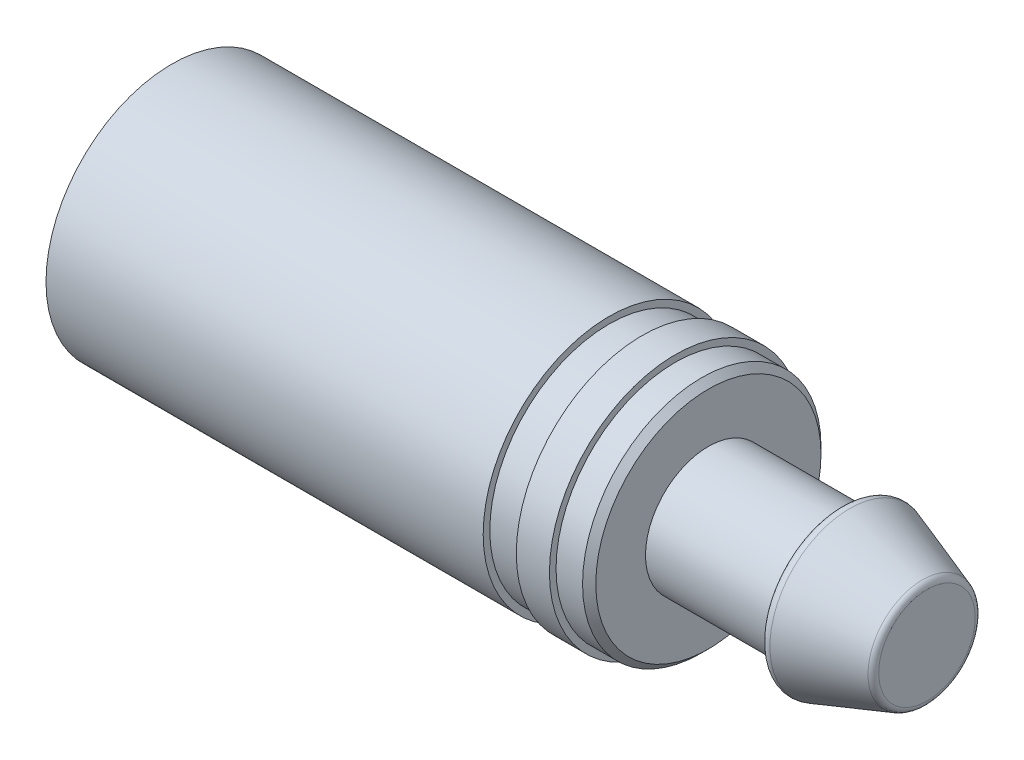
ISO-10303-21;
HEADER;
FILE_DESCRIPTION(('STEP AP214'),'2;1');
FILE_NAME('part.step','',(''),(''),'','','');
FILE_SCHEMA(('AUTOMOTIVE_DESIGN { 1 0 10303 214 1 1 1 1 }'));
ENDSEC;
DATA;
#1=APPLICATION_CONTEXT('core data for automotive mechanical design processes');
#2=APPLICATION_PROTOCOL_DEFINITION('international standard','automotive_design',2000,#1);
#3=PRODUCT_CONTEXT('',#1,'mechanical');
#4=PRODUCT('Part','Part','',(#3));
#5=PRODUCT_RELATED_PRODUCT_CATEGORY('part','',(#4));
#6=PRODUCT_DEFINITION_FORMATION('','',#4);
#7=PRODUCT_DEFINITION_CONTEXT('part definition',#1,'design');
#8=PRODUCT_DEFINITION('design','',#6,#7);
#9=PRODUCT_DEFINITION_SHAPE('','',#8);
#10=(LENGTH_UNIT() NAMED_UNIT(*) SI_UNIT(.MILLI.,.METRE.));
#11=(NAMED_UNIT(*) PLANE_ANGLE_UNIT() SI_UNIT($,.RADIAN.));
#12=(NAMED_UNIT(*) SI_UNIT($,.STERADIAN.) SOLID_ANGLE_UNIT());
#13=UNCERTAINTY_MEASURE_WITH_UNIT(LENGTH_MEASURE(1.E-05),#10,'distance_accuracy_value','');
#14=(GEOMETRIC_REPRESENTATION_CONTEXT(3) GLOBAL_UNCERTAINTY_ASSIGNED_CONTEXT((#13)) GLOBAL_UNIT_ASSIGNED_CONTEXT((#10,
#11,#12)) REPRESENTATION_CONTEXT('',''));
#15=CARTESIAN_POINT('',(0.,0.,0.));
#16=DIRECTION('',(0.,0.,1.));
#17=DIRECTION('',(1.,0.,0.));
#18=AXIS2_PLACEMENT_3D('',#15,#16,#17);
#19=CARTESIAN_POINT('',(114.,0.,0.));
#20=DIRECTION('',(-1.,0.,0.));
#21=DIRECTION('',(0.,0.,1.));
#22=AXIS2_PLACEMENT_3D('',#19,#20,#21);
#23=PLANE('',#22);
#24=CARTESIAN_POINT('',(114.,0.,0.));
#25=DIRECTION('',(-1.,0.,0.));
#26=DIRECTION('',(0.,0.,1.));
#27=AXIS2_PLACEMENT_3D('',#24,#25,#26);
#28=CIRCLE('',#27,7.28793719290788);
#29=CARTESIAN_POINT('',(114.,0.,7.28793719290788));
#30=VERTEX_POINT('',#29);
#31=EDGE_CURVE('E46',#30,#30,#28,.F.);
#32=ORIENTED_EDGE('',*,*,#31,.T.);
#33=EDGE_LOOP('',(#32));
#34=FACE_BOUND('',#33,.T.);
#35=ADVANCED_FACE('F31',(#34),#23,.F.);
#36=CARTESIAN_POINT('',(114.,0.,0.));
#37=DIRECTION('',(-1.,0.,0.));
#38=DIRECTION('',(0.,0.,1.));
#39=AXIS2_PLACEMENT_3D('',#36,#37,#38);
#40=CONICAL_SURFACE('',#39,8.,0.333244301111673);
#41=CARTESIAN_POINT('',(113.327110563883,0.,0.));
#42=DIRECTION('',(1.,0.,0.));
#43=DIRECTION('',(0.,0.,-1.));
#44=AXIS2_PLACEMENT_3D('',#41,#42,#43);
#45=CIRCLE('',#44,8.23292326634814);
#46=CARTESIAN_POINT('',(113.327110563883,0.,-8.23292326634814));
#47=VERTEX_POINT('',#46);
#48=EDGE_CURVE('E51',#47,#47,#45,.F.);
#49=ORIENTED_EDGE('',*,*,#48,.T.);
#50=EDGE_LOOP('',(#49));
#51=FACE_BOUND('',#50,.T.);
#52=CARTESIAN_POINT('',(102.327110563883,0.,0.));
#53=DIRECTION('',(1.,0.,0.));
#54=DIRECTION('',(0.,0.,-1.));
#55=AXIS2_PLACEMENT_3D('',#52,#53,#54);
#56=CIRCLE('',#55,12.0406155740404);
#57=CARTESIAN_POINT('',(102.327110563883,0.,-12.0406155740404));
#58=VERTEX_POINT('',#57);
#59=EDGE_CURVE('E54',#58,#58,#56,.T.);
#60=ORIENTED_EDGE('',*,*,#59,.T.);
#61=EDGE_LOOP('',(#60));
#62=FACE_BOUND('',#61,.T.);
#63=ADVANCED_FACE('F133',(#51,#62),#40,.T.);
#64=CARTESIAN_POINT('',(101.,9.5,0.));
#65=DIRECTION('',(1.,0.,0.));
#66=DIRECTION('',(0.,0.,-1.));
#67=AXIS2_PLACEMENT_3D('',#64,#65,#66);
#68=PLANE('',#67);
#69=CARTESIAN_POINT('',(101.,0.,0.));
#70=DIRECTION('',(1.,0.,0.));
#71=DIRECTION('',(0.,0.,-1.));
#72=AXIS2_PLACEMENT_3D('',#69,#70,#71);
#73=CIRCLE('',#72,11.0956295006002);
#74=CARTESIAN_POINT('',(101.,0.,-11.0956295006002));
#75=VERTEX_POINT('',#74);
#76=EDGE_CURVE('E42',#75,#75,#73,.F.);
#77=ORIENTED_EDGE('',*,*,#76,.T.);
#78=EDGE_LOOP('',(#77));
#79=FACE_BOUND('',#78,.T.);
#80=CARTESIAN_POINT('',(101.,0.,0.));
#81=DIRECTION('',(-1.,0.,0.));
#82=DIRECTION('',(0.,0.,1.));
#83=AXIS2_PLACEMENT_3D('',#80,#81,#82);
#84=CIRCLE('',#83,9.5);
#85=CARTESIAN_POINT('',(101.,0.,9.5));
#86=VERTEX_POINT('',#85);
#87=EDGE_CURVE('E57',#86,#86,#84,.T.);
#88=ORIENTED_EDGE('',*,*,#87,.F.);
#89=EDGE_LOOP('',(#88));
#90=FACE_BOUND('',#89,.T.);
#91=ADVANCED_FACE('F139',(#79,#90),#68,.F.);
#92=CARTESIAN_POINT('',(0.,0.,0.));
#93=DIRECTION('',(-1.,0.,0.));
#94=DIRECTION('',(0.,0.,1.));
#95=AXIS2_PLACEMENT_3D('',#92,#93,#94);
#96=CYLINDRICAL_SURFACE('',#95,9.5);
#97=CARTESIAN_POINT('',(81.,0.,0.));
#98=DIRECTION('',(-1.,0.,0.));
#99=DIRECTION('',(0.,0.,1.));
#100=AXIS2_PLACEMENT_3D('',#97,#98,#99);
#101=CIRCLE('',#100,9.5);
#102=CARTESIAN_POINT('',(81.,0.,9.5));
#103=VERTEX_POINT('',#102);
#104=EDGE_CURVE('E60',#103,#103,#101,.T.);
#105=ORIENTED_EDGE('',*,*,#104,.F.);
#106=EDGE_LOOP('',(#105));
#107=FACE_BOUND('',#106,.T.);
#108=ORIENTED_EDGE('',*,*,#87,.T.);
#109=EDGE_LOOP('',(#108));
#110=FACE_BOUND('',#109,.T.);
#111=ADVANCED_FACE('F130',(#107,#110),#96,.T.);
#112=CARTESIAN_POINT('',(81.,18.,0.));
#113=DIRECTION('',(-1.,0.,0.));
#114=DIRECTION('',(0.,0.,1.));
#115=AXIS2_PLACEMENT_3D('',#112,#113,#114);
#116=PLANE('',#115);
#117=CARTESIAN_POINT('',(81.,0.,0.));
#118=DIRECTION('',(-1.,0.,0.));
#119=DIRECTION('',(0.,0.,1.));
#120=AXIS2_PLACEMENT_3D('',#117,#118,#119);
#121=CIRCLE('',#120,17.);
#122=CARTESIAN_POINT('',(81.,0.,17.));
#123=VERTEX_POINT('',#122);
#124=EDGE_CURVE('E10',#123,#123,#121,.F.);
#125=ORIENTED_EDGE('',*,*,#124,.T.);
#126=EDGE_LOOP('',(#125));
#127=FACE_BOUND('',#126,.T.);
#128=ORIENTED_EDGE('',*,*,#104,.T.);
#129=EDGE_LOOP('',(#128));
#130=FACE_BOUND('',#129,.T.);
#131=ADVANCED_FACE('F125',(#127,#130),#116,.F.);
#132=CARTESIAN_POINT('',(0.,0.,0.));
#133=DIRECTION('',(-1.,0.,0.));
#134=DIRECTION('',(0.,0.,1.));
#135=AXIS2_PLACEMENT_3D('',#132,#133,#134);
#136=CYLINDRICAL_SURFACE('',#135,18.);
#137=CARTESIAN_POINT('',(80.,0.,0.));
#138=DIRECTION('',(-1.,0.,0.));
#139=DIRECTION('',(0.,0.,1.));
#140=AXIS2_PLACEMENT_3D('',#137,#138,#139);
#141=CIRCLE('',#140,18.);
#142=CARTESIAN_POINT('',(80.,0.,18.));
#143=VERTEX_POINT('',#142);
#144=EDGE_CURVE('E38',#143,#143,#141,.T.);
#145=ORIENTED_EDGE('',*,*,#144,.T.);
#146=EDGE_LOOP('',(#145));
#147=FACE_BOUND('',#146,.T.);
#148=CARTESIAN_POINT('',(76.,0.,0.));
#149=DIRECTION('',(-1.,0.,0.));
#150=DIRECTION('',(0.,0.,1.));
#151=AXIS2_PLACEMENT_3D('',#148,#149,#150);
#152=CIRCLE('',#151,18.);
#153=CARTESIAN_POINT('',(76.,0.,18.));
#154=VERTEX_POINT('',#153);
#155=EDGE_CURVE('E63',#154,#154,#152,.T.);
#156=ORIENTED_EDGE('',*,*,#155,.F.);
#157=EDGE_LOOP('',(#156));
#158=FACE_BOUND('',#157,.T.);
#159=ADVANCED_FACE('F120',(#147,#158),#136,.T.);
#160=CARTESIAN_POINT('',(76.,19.,0.));
#161=DIRECTION('',(-1.,0.,0.));
#162=DIRECTION('',(0.,0.,1.));
#163=AXIS2_PLACEMENT_3D('',#160,#161,#162);
#164=PLANE('',#163);
#165=CARTESIAN_POINT('',(76.,0.,0.));
#166=DIRECTION('',(-1.,0.,0.));
#167=DIRECTION('',(0.,0.,1.));
#168=AXIS2_PLACEMENT_3D('',#165,#166,#167);
#169=CIRCLE('',#168,19.);
#170=CARTESIAN_POINT('',(76.,0.,19.));
#171=VERTEX_POINT('',#170);
#172=EDGE_CURVE('E66',#171,#171,#169,.T.);
#173=ORIENTED_EDGE('',*,*,#172,.F.);
#174=EDGE_LOOP('',(#173));
#175=FACE_BOUND('',#174,.T.);
#176=ORIENTED_EDGE('',*,*,#155,.T.);
#177=EDGE_LOOP('',(#176));
#178=FACE_BOUND('',#177,.T.);
#179=ADVANCED_FACE('F114',(#175,#178),#164,.F.);
#180=CARTESIAN_POINT('',(0.,0.,0.));
#181=DIRECTION('',(-1.,0.,0.));
#182=DIRECTION('',(0.,0.,1.));
#183=AXIS2_PLACEMENT_3D('',#180,#181,#182);
#184=CYLINDRICAL_SURFACE('',#183,19.);
#185=CARTESIAN_POINT('',(71.,0.,0.));
#186=DIRECTION('',(-1.,0.,0.));
#187=DIRECTION('',(0.,0.,1.));
#188=AXIS2_PLACEMENT_3D('',#185,#186,#187);
#189=CIRCLE('',#188,19.);
#190=CARTESIAN_POINT('',(71.,0.,19.));
#191=VERTEX_POINT('',#190);
#192=EDGE_CURVE('E69',#191,#191,#189,.T.);
#193=ORIENTED_EDGE('',*,*,#192,.F.);
#194=EDGE_LOOP('',(#193));
#195=FACE_BOUND('',#194,.T.);
#196=ORIENTED_EDGE('',*,*,#172,.T.);
#197=EDGE_LOOP('',(#196));
#198=FACE_BOUND('',#197,.T.);
#199=ADVANCED_FACE('F108',(#195,#198),#184,.T.);
#200=CARTESIAN_POINT('',(71.,18.,0.));
#201=DIRECTION('',(1.,0.,0.));
#202=DIRECTION('',(0.,0.,-1.));
#203=AXIS2_PLACEMENT_3D('',#200,#201,#202);
#204=PLANE('',#203);
#205=CARTESIAN_POINT('',(71.,0.,0.));
#206=DIRECTION('',(-1.,0.,0.));
#207=DIRECTION('',(0.,0.,1.));
#208=AXIS2_PLACEMENT_3D('',#205,#206,#207);
#209=CIRCLE('',#208,18.);
#210=CARTESIAN_POINT('',(71.,0.,18.));
#211=VERTEX_POINT('',#210);
#212=EDGE_CURVE('E72',#211,#211,#209,.T.);
#213=ORIENTED_EDGE('',*,*,#212,.F.);
#214=EDGE_LOOP('',(#213));
#215=FACE_BOUND('',#214,.T.);
#216=ORIENTED_EDGE('',*,*,#192,.T.);
#217=EDGE_LOOP('',(#216));
#218=FACE_BOUND('',#217,.T.);
#219=ADVANCED_FACE('F102',(#215,#218),#204,.F.);
#220=CARTESIAN_POINT('',(0.,0.,0.));
#221=DIRECTION('',(-1.,0.,0.));
#222=DIRECTION('',(0.,0.,1.));
#223=AXIS2_PLACEMENT_3D('',#220,#221,#222);
#224=CYLINDRICAL_SURFACE('',#223,18.);
#225=CARTESIAN_POINT('',(66.,0.,0.));
#226=DIRECTION('',(-1.,0.,0.));
#227=DIRECTION('',(0.,0.,1.));
#228=AXIS2_PLACEMENT_3D('',#225,#226,#227);
#229=CIRCLE('',#228,18.);
#230=CARTESIAN_POINT('',(66.,0.,18.));
#231=VERTEX_POINT('',#230);
#232=EDGE_CURVE('E75',#231,#231,#229,.T.);
#233=ORIENTED_EDGE('',*,*,#232,.F.);
#234=EDGE_LOOP('',(#233));
#235=FACE_BOUND('',#234,.T.);
#236=ORIENTED_EDGE('',*,*,#212,.T.);
#237=EDGE_LOOP('',(#236));
#238=FACE_BOUND('',#237,.T.);
#239=ADVANCED_FACE('F96',(#235,#238),#224,.T.);
#240=CARTESIAN_POINT('',(66.,19.,0.));
#241=DIRECTION('',(-1.,0.,0.));
#242=DIRECTION('',(0.,0.,1.));
#243=AXIS2_PLACEMENT_3D('',#240,#241,#242);
#244=PLANE('',#243);
#245=CARTESIAN_POINT('',(66.,0.,0.));
#246=DIRECTION('',(-1.,0.,0.));
#247=DIRECTION('',(0.,0.,1.));
#248=AXIS2_PLACEMENT_3D('',#245,#246,#247);
#249=CIRCLE('',#248,19.);
#250=CARTESIAN_POINT('',(66.,0.,19.));
#251=VERTEX_POINT('',#250);
#252=EDGE_CURVE('E78',#251,#251,#249,.T.);
#253=ORIENTED_EDGE('',*,*,#252,.F.);
#254=EDGE_LOOP('',(#253));
#255=FACE_BOUND('',#254,.T.);
#256=ORIENTED_EDGE('',*,*,#232,.T.);
#257=EDGE_LOOP('',(#256));
#258=FACE_BOUND('',#257,.T.);
#259=ADVANCED_FACE('F90',(#255,#258),#244,.F.);
#260=CARTESIAN_POINT('',(0.,0.,0.));
#261=DIRECTION('',(-1.,0.,0.));
#262=DIRECTION('',(0.,0.,1.));
#263=AXIS2_PLACEMENT_3D('',#260,#261,#262);
#264=CYLINDRICAL_SURFACE('',#263,19.);
#265=CARTESIAN_POINT('',(0.,0.,0.));
#266=DIRECTION('',(-1.,0.,0.));
#267=DIRECTION('',(0.,0.,1.));
#268=AXIS2_PLACEMENT_3D('',#265,#266,#267);
#269=CIRCLE('',#268,19.);
#270=CARTESIAN_POINT('',(0.,0.,19.));
#271=VERTEX_POINT('',#270);
#272=EDGE_CURVE('E81',#271,#271,#269,.T.);
#273=ORIENTED_EDGE('',*,*,#272,.F.);
#274=EDGE_LOOP('',(#273));
#275=FACE_BOUND('',#274,.T.);
#276=ORIENTED_EDGE('',*,*,#252,.T.);
#277=EDGE_LOOP('',(#276));
#278=FACE_BOUND('',#277,.T.);
#279=ADVANCED_FACE('F87',(#275,#278),#264,.T.);
#280=CARTESIAN_POINT('',(0.,0.,0.));
#281=DIRECTION('',(1.,0.,0.));
#282=DIRECTION('',(0.,0.,-1.));
#283=AXIS2_PLACEMENT_3D('',#280,#281,#282);
#284=PLANE('',#283);
#285=ORIENTED_EDGE('',*,*,#272,.T.);
#286=EDGE_LOOP('',(#285));
#287=FACE_BOUND('',#286,.T.);
#288=ADVANCED_FACE('F85',(#287),#284,.F.);
#289=CARTESIAN_POINT('',(113.,0.,0.));
#290=DIRECTION('',(-1.,0.,0.));
#291=DIRECTION('',(0.,0.,1.));
#292=AXIS2_PLACEMENT_3D('',#289,#290,#291);
#293=TOROIDAL_SURFACE('',#292,7.28793719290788,1.);
#294=ORIENTED_EDGE('',*,*,#31,.F.);
#295=EDGE_LOOP('',(#294));
#296=FACE_BOUND('',#295,.T.);
#297=ORIENTED_EDGE('',*,*,#48,.F.);
#298=EDGE_LOOP('',(#297));
#299=FACE_BOUND('',#298,.T.);
#300=ADVANCED_FACE('F144',(#296,#299),#293,.T.);
#301=CARTESIAN_POINT('',(102.,0.,0.));
#302=DIRECTION('',(1.,0.,0.));
#303=DIRECTION('',(0.,0.,-1.));
#304=AXIS2_PLACEMENT_3D('',#301,#302,#303);
#305=TOROIDAL_SURFACE('',#304,11.0956295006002,1.);
#306=ORIENTED_EDGE('',*,*,#59,.F.);
#307=EDGE_LOOP('',(#306));
#308=FACE_BOUND('',#307,.T.);
#309=ORIENTED_EDGE('',*,*,#76,.F.);
#310=EDGE_LOOP('',(#309));
#311=FACE_BOUND('',#310,.T.);
#312=ADVANCED_FACE('F146',(#308,#311),#305,.T.);
#313=CARTESIAN_POINT('',(80.,0.,0.));
#314=DIRECTION('',(-1.,0.,0.));
#315=DIRECTION('',(0.,0.,1.));
#316=AXIS2_PLACEMENT_3D('',#313,#314,#315);
#317=CONICAL_SURFACE('',#316,18.,0.785398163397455);
#318=ORIENTED_EDGE('',*,*,#124,.F.);
#319=EDGE_LOOP('',(#318));
#320=FACE_BOUND('',#319,.T.);
#321=ORIENTED_EDGE('',*,*,#144,.F.);
#322=EDGE_LOOP('',(#321));
#323=FACE_BOUND('',#322,.T.);
#324=ADVANCED_FACE('F33',(#320,#323),#317,.T.);
#325=CLOSED_SHELL('',(#35,#63,#91,#111,#131,#159,#179,#199,#219,#239,#259,#279,#288,#300,#312,#324));
#326=MANIFOLD_SOLID_BREP('B2',#325);
#327=ADVANCED_BREP_SHAPE_REPRESENTATION('',(#18,#326),#14);
#328=SHAPE_DEFINITION_REPRESENTATION(#9,#327);
ENDSEC;
END-ISO-10303-21;
